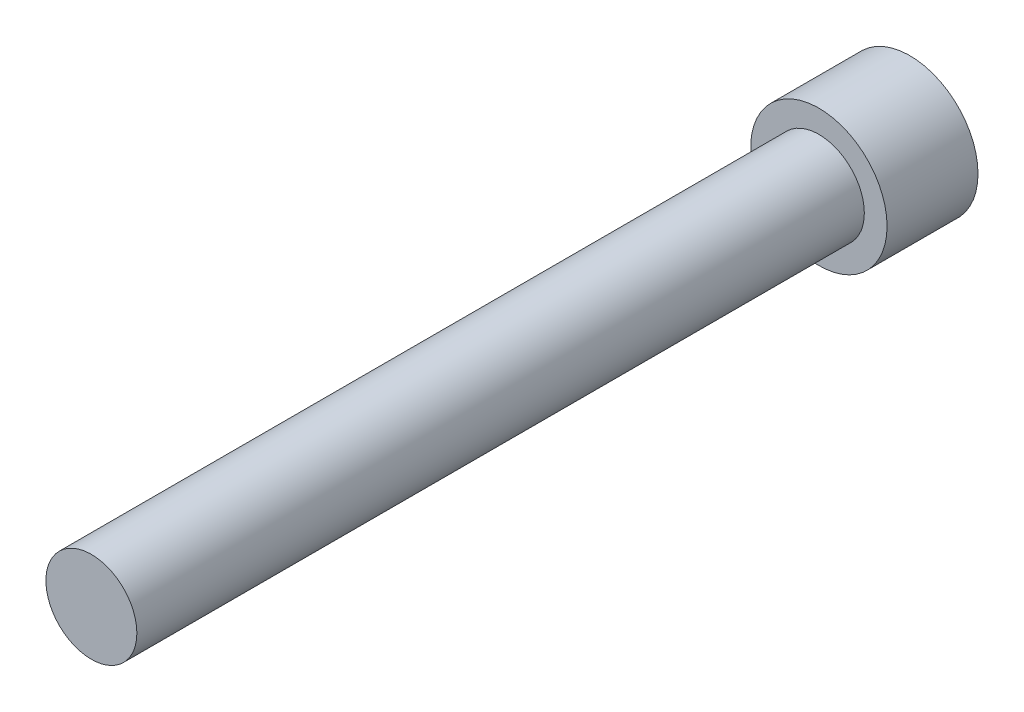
ISO-10303-21;
HEADER;
FILE_DESCRIPTION(('STEP AP214'),'2;1');
FILE_NAME('part.step','',(''),(''),'','','');
FILE_SCHEMA(('AUTOMOTIVE_DESIGN { 1 0 10303 214 1 1 1 1 }'));
ENDSEC;
DATA;
#1=APPLICATION_CONTEXT('core data for automotive mechanical design processes');
#2=APPLICATION_PROTOCOL_DEFINITION('international standard','automotive_design',2000,#1);
#3=PRODUCT_CONTEXT('',#1,'mechanical');
#4=PRODUCT('Part','Part','',(#3));
#5=PRODUCT_RELATED_PRODUCT_CATEGORY('part','',(#4));
#6=PRODUCT_DEFINITION_FORMATION('','',#4);
#7=PRODUCT_DEFINITION_CONTEXT('part definition',#1,'design');
#8=PRODUCT_DEFINITION('design','',#6,#7);
#9=PRODUCT_DEFINITION_SHAPE('','',#8);
#10=(LENGTH_UNIT() NAMED_UNIT(*) SI_UNIT(.MILLI.,.METRE.));
#11=(NAMED_UNIT(*) PLANE_ANGLE_UNIT() SI_UNIT($,.RADIAN.));
#12=(NAMED_UNIT(*) SI_UNIT($,.STERADIAN.) SOLID_ANGLE_UNIT());
#13=UNCERTAINTY_MEASURE_WITH_UNIT(LENGTH_MEASURE(1.E-05),#10,'distance_accuracy_value','');
#14=(GEOMETRIC_REPRESENTATION_CONTEXT(3) GLOBAL_UNCERTAINTY_ASSIGNED_CONTEXT((#13)) GLOBAL_UNIT_ASSIGNED_CONTEXT((#10,
#11,#12)) REPRESENTATION_CONTEXT('',''));
#15=CARTESIAN_POINT('',(0.,0.,0.));
#16=DIRECTION('',(0.,0.,1.));
#17=DIRECTION('',(1.,0.,0.));
#18=AXIS2_PLACEMENT_3D('',#15,#16,#17);
#19=CARTESIAN_POINT('',(0.,-4.7625,-6.35));
#20=DIRECTION('',(0.,0.,-1.));
#21=DIRECTION('',(-1.,0.,0.));
#22=AXIS2_PLACEMENT_3D('',#19,#20,#21);
#23=PLANE('',#22);
#24=DIRECTION('',(0.866025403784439,-0.5,0.));
#25=VECTOR('',#24,1.);
#26=CARTESIAN_POINT('',(0.,2.7569630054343,-6.35));
#27=LINE('',#26,#25);
#28=CARTESIAN_POINT('',(0.,2.7569630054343,-6.35));
#29=VERTEX_POINT('',#28);
#30=CARTESIAN_POINT('',(2.3876,1.37848150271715,-6.35));
#31=VERTEX_POINT('',#30);
#32=EDGE_CURVE('E46',#29,#31,#27,.T.);
#33=ORIENTED_EDGE('',*,*,#32,.F.);
#34=DIRECTION('',(0.866025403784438,0.5,0.));
#35=VECTOR('',#34,1.);
#36=CARTESIAN_POINT('',(-2.3876,1.37848150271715,-6.35));
#37=LINE('',#36,#35);
#38=CARTESIAN_POINT('',(-2.3876,1.37848150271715,-6.35));
#39=VERTEX_POINT('',#38);
#40=EDGE_CURVE('E129',#39,#29,#37,.T.);
#41=ORIENTED_EDGE('',*,*,#40,.F.);
#42=DIRECTION('',(0.,1.,0.));
#43=VECTOR('',#42,1.);
#44=CARTESIAN_POINT('',(-2.3876,-1.37848150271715,-6.35));
#45=LINE('',#44,#43);
#46=CARTESIAN_POINT('',(-2.3876,-1.37848150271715,-6.35));
#47=VERTEX_POINT('',#46);
#48=EDGE_CURVE('E127',#47,#39,#45,.T.);
#49=ORIENTED_EDGE('',*,*,#48,.F.);
#50=DIRECTION('',(-0.866025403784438,0.5,0.));
#51=VECTOR('',#50,1.);
#52=CARTESIAN_POINT('',(0.,-2.7569630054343,-6.35));
#53=LINE('',#52,#51);
#54=CARTESIAN_POINT('',(0.,-2.7569630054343,-6.35));
#55=VERTEX_POINT('',#54);
#56=EDGE_CURVE('E94',#55,#47,#53,.T.);
#57=ORIENTED_EDGE('',*,*,#56,.F.);
#58=DIRECTION('',(-0.866025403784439,-0.5,0.));
#59=VECTOR('',#58,1.);
#60=CARTESIAN_POINT('',(2.3876,-1.37848150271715,-6.35));
#61=LINE('',#60,#59);
#62=CARTESIAN_POINT('',(2.3876,-1.37848150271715,-6.35));
#63=VERTEX_POINT('',#62);
#64=EDGE_CURVE('E123',#63,#55,#61,.T.);
#65=ORIENTED_EDGE('',*,*,#64,.F.);
#66=DIRECTION('',(0.,-1.,0.));
#67=VECTOR('',#66,1.);
#68=CARTESIAN_POINT('',(2.3876,1.37848150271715,-6.35));
#69=LINE('',#68,#67);
#70=EDGE_CURVE('E120',#31,#63,#69,.T.);
#71=ORIENTED_EDGE('',*,*,#70,.F.);
#72=EDGE_LOOP('',(#33,#41,#49,#57,#65,#71));
#73=FACE_BOUND('',#72,.T.);
#74=CARTESIAN_POINT('',(0.,0.,-6.35));
#75=DIRECTION('',(0.,0.,1.));
#76=DIRECTION('',(1.,0.,0.));
#77=AXIS2_PLACEMENT_3D('',#74,#75,#76);
#78=CIRCLE('',#77,4.7625);
#79=CARTESIAN_POINT('',(4.7625,0.,-6.35));
#80=VERTEX_POINT('',#79);
#81=EDGE_CURVE('E11',#80,#80,#78,.T.);
#82=ORIENTED_EDGE('',*,*,#81,.F.);
#83=EDGE_LOOP('',(#82));
#84=FACE_BOUND('',#83,.T.);
#85=ADVANCED_FACE('F32',(#73,#84),#23,.T.);
#86=CARTESIAN_POINT('',(0.,0.,50.8));
#87=DIRECTION('',(0.,0.,1.));
#88=DIRECTION('',(1.,0.,0.));
#89=AXIS2_PLACEMENT_3D('',#86,#87,#88);
#90=CYLINDRICAL_SURFACE('',#89,4.7625);
#91=ORIENTED_EDGE('',*,*,#81,.T.);
#92=EDGE_LOOP('',(#91));
#93=FACE_BOUND('',#92,.T.);
#94=CARTESIAN_POINT('',(0.,0.,0.));
#95=DIRECTION('',(0.,0.,1.));
#96=DIRECTION('',(1.,0.,0.));
#97=AXIS2_PLACEMENT_3D('',#94,#95,#96);
#98=CIRCLE('',#97,4.7625);
#99=CARTESIAN_POINT('',(4.7625,0.,0.));
#100=VERTEX_POINT('',#99);
#101=EDGE_CURVE('E39',#100,#100,#98,.T.);
#102=ORIENTED_EDGE('',*,*,#101,.F.);
#103=EDGE_LOOP('',(#102));
#104=FACE_BOUND('',#103,.T.);
#105=ADVANCED_FACE('F149',(#93,#104),#90,.T.);
#106=CARTESIAN_POINT('',(0.,-3.175,0.));
#107=DIRECTION('',(0.,0.,1.));
#108=DIRECTION('',(1.,0.,0.));
#109=AXIS2_PLACEMENT_3D('',#106,#107,#108);
#110=PLANE('',#109);
#111=ORIENTED_EDGE('',*,*,#101,.T.);
#112=EDGE_LOOP('',(#111));
#113=FACE_BOUND('',#112,.T.);
#114=CARTESIAN_POINT('',(0.,0.,0.));
#115=DIRECTION('',(0.,0.,1.));
#116=DIRECTION('',(1.,0.,0.));
#117=AXIS2_PLACEMENT_3D('',#114,#115,#116);
#118=CIRCLE('',#117,3.175);
#119=CARTESIAN_POINT('',(3.175,0.,0.));
#120=VERTEX_POINT('',#119);
#121=EDGE_CURVE('E141',#120,#120,#118,.T.);
#122=ORIENTED_EDGE('',*,*,#121,.F.);
#123=EDGE_LOOP('',(#122));
#124=FACE_BOUND('',#123,.T.);
#125=ADVANCED_FACE('F146',(#113,#124),#110,.T.);
#126=CARTESIAN_POINT('',(0.,0.,50.8));
#127=DIRECTION('',(0.,0.,1.));
#128=DIRECTION('',(1.,0.,0.));
#129=AXIS2_PLACEMENT_3D('',#126,#127,#128);
#130=CYLINDRICAL_SURFACE('',#129,3.175);
#131=ORIENTED_EDGE('',*,*,#121,.T.);
#132=EDGE_LOOP('',(#131));
#133=FACE_BOUND('',#132,.T.);
#134=CARTESIAN_POINT('',(0.,0.,50.8));
#135=DIRECTION('',(0.,0.,1.));
#136=DIRECTION('',(1.,0.,0.));
#137=AXIS2_PLACEMENT_3D('',#134,#135,#136);
#138=CIRCLE('',#137,3.175);
#139=CARTESIAN_POINT('',(3.175,0.,50.8));
#140=VERTEX_POINT('',#139);
#141=EDGE_CURVE('E133',#140,#140,#138,.T.);
#142=ORIENTED_EDGE('',*,*,#141,.F.);
#143=EDGE_LOOP('',(#142));
#144=FACE_BOUND('',#143,.T.);
#145=ADVANCED_FACE('F156',(#133,#144),#130,.T.);
#146=CARTESIAN_POINT('',(0.,0.,50.8));
#147=DIRECTION('',(0.,0.,1.));
#148=DIRECTION('',(1.,0.,0.));
#149=AXIS2_PLACEMENT_3D('',#146,#147,#148);
#150=PLANE('',#149);
#151=ORIENTED_EDGE('',*,*,#141,.T.);
#152=EDGE_LOOP('',(#151));
#153=FACE_BOUND('',#152,.T.);
#154=ADVANCED_FACE('F162',(#153),#150,.T.);
#155=CARTESIAN_POINT('',(0.,2.7569630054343,-2.794));
#156=DIRECTION('',(0.5,0.866025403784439,0.));
#157=DIRECTION('',(-0.866025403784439,0.5,0.));
#158=AXIS2_PLACEMENT_3D('',#155,#156,#157);
#159=PLANE('',#158);
#160=ORIENTED_EDGE('',*,*,#32,.T.);
#161=DIRECTION('',(0.,0.,-1.));
#162=VECTOR('',#161,1.);
#163=CARTESIAN_POINT('',(2.3876,1.37848150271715,-2.794));
#164=LINE('',#163,#162);
#165=CARTESIAN_POINT('',(2.3876,1.37848150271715,-2.794));
#166=VERTEX_POINT('',#165);
#167=EDGE_CURVE('E76',#166,#31,#164,.T.);
#168=ORIENTED_EDGE('',*,*,#167,.F.);
#169=DIRECTION('',(0.866025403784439,-0.5,0.));
#170=VECTOR('',#169,1.);
#171=CARTESIAN_POINT('',(0.,2.7569630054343,-2.794));
#172=LINE('',#171,#170);
#173=CARTESIAN_POINT('',(0.,2.7569630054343,-2.794));
#174=VERTEX_POINT('',#173);
#175=EDGE_CURVE('E131',#174,#166,#172,.T.);
#176=ORIENTED_EDGE('',*,*,#175,.F.);
#177=DIRECTION('',(0.,0.,-1.));
#178=VECTOR('',#177,1.);
#179=CARTESIAN_POINT('',(0.,2.7569630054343,-2.794));
#180=LINE('',#179,#178);
#181=EDGE_CURVE('E54',#174,#29,#180,.T.);
#182=ORIENTED_EDGE('',*,*,#181,.T.);
#183=EDGE_LOOP('',(#160,#168,#176,#182));
#184=FACE_BOUND('',#183,.T.);
#185=ADVANCED_FACE('F166',(#184),#159,.F.);
#186=CARTESIAN_POINT('',(-2.3876,1.37848150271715,-2.794));
#187=DIRECTION('',(-0.5,0.866025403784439,0.));
#188=DIRECTION('',(-0.866025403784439,-0.5,0.));
#189=AXIS2_PLACEMENT_3D('',#186,#187,#188);
#190=PLANE('',#189);
#191=ORIENTED_EDGE('',*,*,#40,.T.);
#192=ORIENTED_EDGE('',*,*,#181,.F.);
#193=DIRECTION('',(0.866025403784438,0.5,0.));
#194=VECTOR('',#193,1.);
#195=CARTESIAN_POINT('',(-2.3876,1.37848150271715,-2.794));
#196=LINE('',#195,#194);
#197=CARTESIAN_POINT('',(-2.3876,1.37848150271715,-2.794));
#198=VERTEX_POINT('',#197);
#199=EDGE_CURVE('E106',#198,#174,#196,.T.);
#200=ORIENTED_EDGE('',*,*,#199,.F.);
#201=DIRECTION('',(0.,0.,-1.));
#202=VECTOR('',#201,1.);
#203=CARTESIAN_POINT('',(-2.3876,1.37848150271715,-2.794));
#204=LINE('',#203,#202);
#205=EDGE_CURVE('E98',#198,#39,#204,.T.);
#206=ORIENTED_EDGE('',*,*,#205,.T.);
#207=EDGE_LOOP('',(#191,#192,#200,#206));
#208=FACE_BOUND('',#207,.T.);
#209=ADVANCED_FACE('F170',(#208),#190,.F.);
#210=CARTESIAN_POINT('',(-2.3876,-1.37848150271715,-2.794));
#211=DIRECTION('',(-1.,0.,0.));
#212=DIRECTION('',(0.,0.,1.));
#213=AXIS2_PLACEMENT_3D('',#210,#211,#212);
#214=PLANE('',#213);
#215=ORIENTED_EDGE('',*,*,#48,.T.);
#216=ORIENTED_EDGE('',*,*,#205,.F.);
#217=DIRECTION('',(0.,1.,0.));
#218=VECTOR('',#217,1.);
#219=CARTESIAN_POINT('',(-2.3876,-1.37848150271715,-2.794));
#220=LINE('',#219,#218);
#221=CARTESIAN_POINT('',(-2.3876,-1.37848150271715,-2.794));
#222=VERTEX_POINT('',#221);
#223=EDGE_CURVE('E102',#222,#198,#220,.T.);
#224=ORIENTED_EDGE('',*,*,#223,.F.);
#225=DIRECTION('',(0.,0.,-1.));
#226=VECTOR('',#225,1.);
#227=CARTESIAN_POINT('',(-2.3876,-1.37848150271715,-2.794));
#228=LINE('',#227,#226);
#229=EDGE_CURVE('E87',#222,#47,#228,.T.);
#230=ORIENTED_EDGE('',*,*,#229,.T.);
#231=EDGE_LOOP('',(#215,#216,#224,#230));
#232=FACE_BOUND('',#231,.T.);
#233=ADVANCED_FACE('F103',(#232),#214,.F.);
#234=CARTESIAN_POINT('',(0.,-2.7569630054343,-2.794));
#235=DIRECTION('',(-0.5,-0.866025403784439,0.));
#236=DIRECTION('',(0.866025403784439,-0.5,0.));
#237=AXIS2_PLACEMENT_3D('',#234,#235,#236);
#238=PLANE('',#237);
#239=ORIENTED_EDGE('',*,*,#56,.T.);
#240=ORIENTED_EDGE('',*,*,#229,.F.);
#241=DIRECTION('',(-0.866025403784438,0.5,0.));
#242=VECTOR('',#241,1.);
#243=CARTESIAN_POINT('',(0.,-2.7569630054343,-2.794));
#244=LINE('',#243,#242);
#245=CARTESIAN_POINT('',(0.,-2.7569630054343,-2.794));
#246=VERTEX_POINT('',#245);
#247=EDGE_CURVE('E91',#246,#222,#244,.T.);
#248=ORIENTED_EDGE('',*,*,#247,.F.);
#249=DIRECTION('',(0.,0.,-1.));
#250=VECTOR('',#249,1.);
#251=CARTESIAN_POINT('',(0.,-2.7569630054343,-2.794));
#252=LINE('',#251,#250);
#253=EDGE_CURVE('E99',#246,#55,#252,.T.);
#254=ORIENTED_EDGE('',*,*,#253,.T.);
#255=EDGE_LOOP('',(#239,#240,#248,#254));
#256=FACE_BOUND('',#255,.T.);
#257=ADVANCED_FACE('F89',(#256),#238,.F.);
#258=CARTESIAN_POINT('',(2.3876,-1.37848150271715,-2.794));
#259=DIRECTION('',(0.5,-0.866025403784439,0.));
#260=DIRECTION('',(0.866025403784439,0.5,0.));
#261=AXIS2_PLACEMENT_3D('',#258,#259,#260);
#262=PLANE('',#261);
#263=ORIENTED_EDGE('',*,*,#64,.T.);
#264=ORIENTED_EDGE('',*,*,#253,.F.);
#265=DIRECTION('',(-0.866025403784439,-0.5,0.));
#266=VECTOR('',#265,1.);
#267=CARTESIAN_POINT('',(2.3876,-1.37848150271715,-2.794));
#268=LINE('',#267,#266);
#269=CARTESIAN_POINT('',(2.3876,-1.37848150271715,-2.794));
#270=VERTEX_POINT('',#269);
#271=EDGE_CURVE('E112',#270,#246,#268,.T.);
#272=ORIENTED_EDGE('',*,*,#271,.F.);
#273=DIRECTION('',(0.,0.,-1.));
#274=VECTOR('',#273,1.);
#275=CARTESIAN_POINT('',(2.3876,-1.37848150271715,-2.794));
#276=LINE('',#275,#274);
#277=EDGE_CURVE('E136',#270,#63,#276,.T.);
#278=ORIENTED_EDGE('',*,*,#277,.T.);
#279=EDGE_LOOP('',(#263,#264,#272,#278));
#280=FACE_BOUND('',#279,.T.);
#281=ADVANCED_FACE('F174',(#280),#262,.F.);
#282=CARTESIAN_POINT('',(2.3876,1.37848150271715,-2.794));
#283=DIRECTION('',(1.,0.,0.));
#284=DIRECTION('',(0.,0.,-1.));
#285=AXIS2_PLACEMENT_3D('',#282,#283,#284);
#286=PLANE('',#285);
#287=ORIENTED_EDGE('',*,*,#70,.T.);
#288=ORIENTED_EDGE('',*,*,#277,.F.);
#289=DIRECTION('',(0.,-1.,0.));
#290=VECTOR('',#289,1.);
#291=CARTESIAN_POINT('',(2.3876,1.37848150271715,-2.794));
#292=LINE('',#291,#290);
#293=EDGE_CURVE('E114',#166,#270,#292,.T.);
#294=ORIENTED_EDGE('',*,*,#293,.F.);
#295=ORIENTED_EDGE('',*,*,#167,.T.);
#296=EDGE_LOOP('',(#287,#288,#294,#295));
#297=FACE_BOUND('',#296,.T.);
#298=ADVANCED_FACE('F171',(#297),#286,.F.);
#299=CARTESIAN_POINT('',(0.,2.7569630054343,-2.794));
#300=DIRECTION('',(0.,0.,1.));
#301=DIRECTION('',(1.,0.,0.));
#302=AXIS2_PLACEMENT_3D('',#299,#300,#301);
#303=PLANE('',#302);
#304=ORIENTED_EDGE('',*,*,#175,.T.);
#305=ORIENTED_EDGE('',*,*,#293,.T.);
#306=ORIENTED_EDGE('',*,*,#271,.T.);
#307=ORIENTED_EDGE('',*,*,#247,.T.);
#308=ORIENTED_EDGE('',*,*,#223,.T.);
#309=ORIENTED_EDGE('',*,*,#199,.T.);
#310=EDGE_LOOP('',(#304,#305,#306,#307,#308,#309));
#311=FACE_BOUND('',#310,.T.);
#312=ADVANCED_FACE('F109',(#311),#303,.F.);
#313=CLOSED_SHELL('',(#85,#105,#125,#145,#154,#185,#209,#233,#257,#281,#298,#312));
#314=MANIFOLD_SOLID_BREP('B2',#313);
#315=ADVANCED_BREP_SHAPE_REPRESENTATION('',(#18,#314),#14);
#316=SHAPE_DEFINITION_REPRESENTATION(#9,#315);
ENDSEC;
END-ISO-10303-21;
